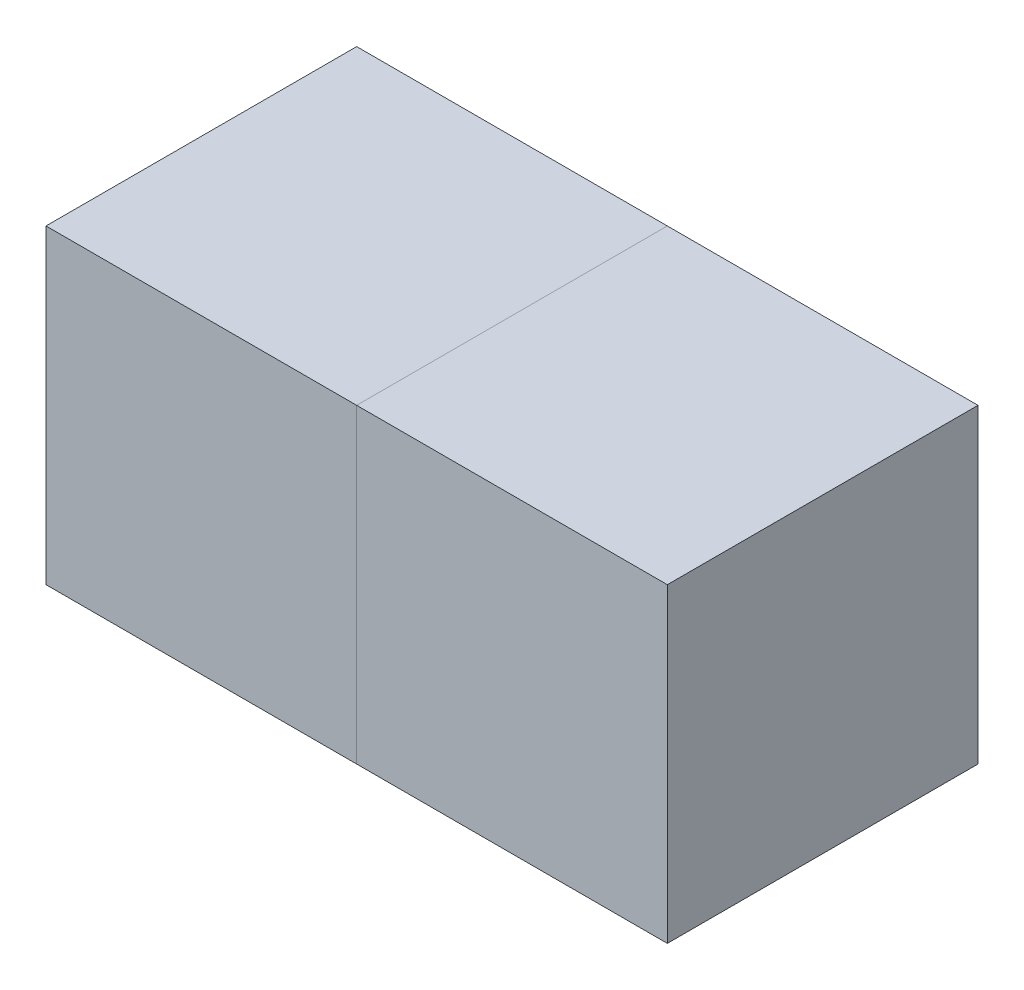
ISO-10303-21;
HEADER;
FILE_DESCRIPTION(('STEP AP214'),'2;1');
FILE_NAME('part.step','',(''),(''),'','','');
FILE_SCHEMA(('AUTOMOTIVE_DESIGN { 1 0 10303 214 1 1 1 1 }'));
ENDSEC;
DATA;
#1=APPLICATION_CONTEXT('core data for automotive mechanical design processes');
#2=APPLICATION_PROTOCOL_DEFINITION('international standard','automotive_design',2000,#1);
#3=PRODUCT_CONTEXT('',#1,'mechanical');
#4=PRODUCT('Part','Part','',(#3));
#5=PRODUCT_RELATED_PRODUCT_CATEGORY('part','',(#4));
#6=PRODUCT_DEFINITION_FORMATION('','',#4);
#7=PRODUCT_DEFINITION_CONTEXT('part definition',#1,'design');
#8=PRODUCT_DEFINITION('design','',#6,#7);
#9=PRODUCT_DEFINITION_SHAPE('','',#8);
#10=(LENGTH_UNIT() NAMED_UNIT(*) SI_UNIT(.MILLI.,.METRE.));
#11=(NAMED_UNIT(*) PLANE_ANGLE_UNIT() SI_UNIT($,.RADIAN.));
#12=(NAMED_UNIT(*) SI_UNIT($,.STERADIAN.) SOLID_ANGLE_UNIT());
#13=UNCERTAINTY_MEASURE_WITH_UNIT(LENGTH_MEASURE(1.E-05),#10,'distance_accuracy_value','');
#14=(GEOMETRIC_REPRESENTATION_CONTEXT(3) GLOBAL_UNCERTAINTY_ASSIGNED_CONTEXT((#13)) GLOBAL_UNIT_ASSIGNED_CONTEXT((#10,
#11,#12)) REPRESENTATION_CONTEXT('',''));
#15=CARTESIAN_POINT('',(0.,0.,0.));
#16=DIRECTION('',(0.,0.,1.));
#17=DIRECTION('',(1.,0.,0.));
#18=AXIS2_PLACEMENT_3D('',#15,#16,#17);
#19=CARTESIAN_POINT('',(50.,50.,50.));
#20=DIRECTION('',(1.,0.,0.));
#21=DIRECTION('',(0.,1.,0.));
#22=AXIS2_PLACEMENT_3D('',#19,#20,#21);
#23=PLANE('',#22);
#24=DIRECTION('',(0.,-1.,0.));
#25=VECTOR('',#24,1.);
#26=CARTESIAN_POINT('',(50.,50.,-50.));
#27=LINE('',#26,#25);
#28=CARTESIAN_POINT('',(50.,50.,-50.));
#29=VERTEX_POINT('',#28);
#30=CARTESIAN_POINT('',(50.,-50.,-50.));
#31=VERTEX_POINT('',#30);
#32=EDGE_CURVE('E86',#29,#31,#27,.T.);
#33=ORIENTED_EDGE('',*,*,#32,.T.);
#34=DIRECTION('',(0.,0.,-1.));
#35=VECTOR('',#34,1.);
#36=CARTESIAN_POINT('',(50.,-50.,50.));
#37=LINE('',#36,#35);
#38=CARTESIAN_POINT('',(50.,-50.,50.));
#39=VERTEX_POINT('',#38);
#40=EDGE_CURVE('E12',#39,#31,#37,.T.);
#41=ORIENTED_EDGE('',*,*,#40,.F.);
#42=DIRECTION('',(0.,-1.,0.));
#43=VECTOR('',#42,1.);
#44=CARTESIAN_POINT('',(50.,50.,50.));
#45=LINE('',#44,#43);
#46=CARTESIAN_POINT('',(50.,50.,50.));
#47=VERTEX_POINT('',#46);
#48=EDGE_CURVE('E104',#47,#39,#45,.T.);
#49=ORIENTED_EDGE('',*,*,#48,.F.);
#50=DIRECTION('',(0.,0.,-1.));
#51=VECTOR('',#50,1.);
#52=CARTESIAN_POINT('',(50.,50.,50.));
#53=LINE('',#52,#51);
#54=EDGE_CURVE('E98',#47,#29,#53,.T.);
#55=ORIENTED_EDGE('',*,*,#54,.T.);
#56=EDGE_LOOP('',(#33,#41,#49,#55));
#57=FACE_BOUND('',#56,.T.);
#58=ADVANCED_FACE('F42',(#57),#23,.F.);
#59=CARTESIAN_POINT('',(50.,-50.,50.));
#60=DIRECTION('',(0.,1.,0.));
#61=DIRECTION('',(0.,0.,1.));
#62=AXIS2_PLACEMENT_3D('',#59,#60,#61);
#63=PLANE('',#62);
#64=DIRECTION('',(1.,0.,0.));
#65=VECTOR('',#64,1.);
#66=CARTESIAN_POINT('',(50.,-50.,-50.));
#67=LINE('',#66,#65);
#68=CARTESIAN_POINT('',(150.,-50.,-50.));
#69=VERTEX_POINT('',#68);
#70=EDGE_CURVE('E82',#31,#69,#67,.T.);
#71=ORIENTED_EDGE('',*,*,#70,.T.);
#72=DIRECTION('',(0.,0.,-1.));
#73=VECTOR('',#72,1.);
#74=CARTESIAN_POINT('',(150.,-50.,50.));
#75=LINE('',#74,#73);
#76=CARTESIAN_POINT('',(150.,-50.,50.));
#77=VERTEX_POINT('',#76);
#78=EDGE_CURVE('E49',#77,#69,#75,.T.);
#79=ORIENTED_EDGE('',*,*,#78,.F.);
#80=DIRECTION('',(1.,0.,0.));
#81=VECTOR('',#80,1.);
#82=CARTESIAN_POINT('',(50.,-50.,50.));
#83=LINE('',#82,#81);
#84=EDGE_CURVE('E94',#39,#77,#83,.T.);
#85=ORIENTED_EDGE('',*,*,#84,.F.);
#86=ORIENTED_EDGE('',*,*,#40,.T.);
#87=EDGE_LOOP('',(#71,#79,#85,#86));
#88=FACE_BOUND('',#87,.T.);
#89=ADVANCED_FACE('F93',(#88),#63,.F.);
#90=CARTESIAN_POINT('',(150.,50.,50.));
#91=DIRECTION('',(-1.,0.,0.));
#92=DIRECTION('',(0.,-1.,0.));
#93=AXIS2_PLACEMENT_3D('',#90,#91,#92);
#94=PLANE('',#93);
#95=DIRECTION('',(0.,1.,0.));
#96=VECTOR('',#95,1.);
#97=CARTESIAN_POINT('',(150.,50.,-50.));
#98=LINE('',#97,#96);
#99=CARTESIAN_POINT('',(150.,50.,-50.));
#100=VERTEX_POINT('',#99);
#101=EDGE_CURVE('E87',#69,#100,#98,.T.);
#102=ORIENTED_EDGE('',*,*,#101,.T.);
#103=DIRECTION('',(0.,0.,-1.));
#104=VECTOR('',#103,1.);
#105=CARTESIAN_POINT('',(150.,50.,50.));
#106=LINE('',#105,#104);
#107=CARTESIAN_POINT('',(150.,50.,50.));
#108=VERTEX_POINT('',#107);
#109=EDGE_CURVE('E110',#108,#100,#106,.T.);
#110=ORIENTED_EDGE('',*,*,#109,.F.);
#111=DIRECTION('',(0.,1.,0.));
#112=VECTOR('',#111,1.);
#113=CARTESIAN_POINT('',(150.,50.,50.));
#114=LINE('',#113,#112);
#115=EDGE_CURVE('E61',#77,#108,#114,.T.);
#116=ORIENTED_EDGE('',*,*,#115,.F.);
#117=ORIENTED_EDGE('',*,*,#78,.T.);
#118=EDGE_LOOP('',(#102,#110,#116,#117));
#119=FACE_BOUND('',#118,.T.);
#120=ADVANCED_FACE('F113',(#119),#94,.F.);
#121=CARTESIAN_POINT('',(50.,50.,50.));
#122=DIRECTION('',(0.,-1.,0.));
#123=DIRECTION('',(0.,0.,-1.));
#124=AXIS2_PLACEMENT_3D('',#121,#122,#123);
#125=PLANE('',#124);
#126=DIRECTION('',(-1.,0.,0.));
#127=VECTOR('',#126,1.);
#128=CARTESIAN_POINT('',(50.,50.,-50.));
#129=LINE('',#128,#127);
#130=EDGE_CURVE('E102',#100,#29,#129,.T.);
#131=ORIENTED_EDGE('',*,*,#130,.T.);
#132=ORIENTED_EDGE('',*,*,#54,.F.);
#133=DIRECTION('',(-1.,0.,0.));
#134=VECTOR('',#133,1.);
#135=CARTESIAN_POINT('',(50.,50.,50.));
#136=LINE('',#135,#134);
#137=EDGE_CURVE('E56',#108,#47,#136,.T.);
#138=ORIENTED_EDGE('',*,*,#137,.F.);
#139=ORIENTED_EDGE('',*,*,#109,.T.);
#140=EDGE_LOOP('',(#131,#132,#138,#139));
#141=FACE_BOUND('',#140,.T.);
#142=ADVANCED_FACE('F115',(#141),#125,.F.);
#143=CARTESIAN_POINT('',(50.,-50.,50.));
#144=DIRECTION('',(0.,0.,1.));
#145=DIRECTION('',(1.,0.,0.));
#146=AXIS2_PLACEMENT_3D('',#143,#144,#145);
#147=PLANE('',#146);
#148=ORIENTED_EDGE('',*,*,#48,.T.);
#149=ORIENTED_EDGE('',*,*,#84,.T.);
#150=ORIENTED_EDGE('',*,*,#115,.T.);
#151=ORIENTED_EDGE('',*,*,#137,.T.);
#152=EDGE_LOOP('',(#148,#149,#150,#151));
#153=FACE_BOUND('',#152,.T.);
#154=ADVANCED_FACE('F116',(#153),#147,.T.);
#155=CARTESIAN_POINT('',(50.,-50.,-50.));
#156=DIRECTION('',(0.,0.,1.));
#157=DIRECTION('',(1.,0.,0.));
#158=AXIS2_PLACEMENT_3D('',#155,#156,#157);
#159=PLANE('',#158);
#160=ORIENTED_EDGE('',*,*,#32,.F.);
#161=ORIENTED_EDGE('',*,*,#130,.F.);
#162=ORIENTED_EDGE('',*,*,#101,.F.);
#163=ORIENTED_EDGE('',*,*,#70,.F.);
#164=EDGE_LOOP('',(#160,#161,#162,#163));
#165=FACE_BOUND('',#164,.T.);
#166=ADVANCED_FACE('F83',(#165),#159,.F.);
#167=CLOSED_SHELL('',(#58,#89,#120,#142,#154,#166));
#168=MANIFOLD_SOLID_BREP('B2',#167);
#169=CARTESIAN_POINT('',(-50.,50.,50.));
#170=DIRECTION('',(1.,0.,0.));
#171=DIRECTION('',(0.,1.,0.));
#172=AXIS2_PLACEMENT_3D('',#169,#170,#171);
#173=PLANE('',#172);
#174=DIRECTION('',(0.,-1.,0.));
#175=VECTOR('',#174,1.);
#176=CARTESIAN_POINT('',(-50.,50.,-50.));
#177=LINE('',#176,#175);
#178=CARTESIAN_POINT('',(-50.,50.,-50.));
#179=VERTEX_POINT('',#178);
#180=CARTESIAN_POINT('',(-50.,-50.,-50.));
#181=VERTEX_POINT('',#180);
#182=EDGE_CURVE('E209',#179,#181,#177,.T.);
#183=ORIENTED_EDGE('',*,*,#182,.T.);
#184=DIRECTION('',(0.,0.,-1.));
#185=VECTOR('',#184,1.);
#186=CARTESIAN_POINT('',(-50.,-50.,50.));
#187=LINE('',#186,#185);
#188=CARTESIAN_POINT('',(-50.,-50.,50.));
#189=VERTEX_POINT('',#188);
#190=EDGE_CURVE('E40',#189,#181,#187,.T.);
#191=ORIENTED_EDGE('',*,*,#190,.F.);
#192=DIRECTION('',(0.,-1.,0.));
#193=VECTOR('',#192,1.);
#194=CARTESIAN_POINT('',(-50.,50.,50.));
#195=LINE('',#194,#193);
#196=CARTESIAN_POINT('',(-50.,50.,50.));
#197=VERTEX_POINT('',#196);
#198=EDGE_CURVE('E227',#197,#189,#195,.T.);
#199=ORIENTED_EDGE('',*,*,#198,.F.);
#200=DIRECTION('',(0.,0.,-1.));
#201=VECTOR('',#200,1.);
#202=CARTESIAN_POINT('',(-50.,50.,50.));
#203=LINE('',#202,#201);
#204=EDGE_CURVE('E221',#197,#179,#203,.T.);
#205=ORIENTED_EDGE('',*,*,#204,.T.);
#206=EDGE_LOOP('',(#183,#191,#199,#205));
#207=FACE_BOUND('',#206,.T.);
#208=ADVANCED_FACE('F165',(#207),#173,.F.);
#209=CARTESIAN_POINT('',(-50.,-50.,50.));
#210=DIRECTION('',(0.,1.,0.));
#211=DIRECTION('',(0.,0.,1.));
#212=AXIS2_PLACEMENT_3D('',#209,#210,#211);
#213=PLANE('',#212);
#214=DIRECTION('',(1.,0.,0.));
#215=VECTOR('',#214,1.);
#216=CARTESIAN_POINT('',(-50.,-50.,-50.));
#217=LINE('',#216,#215);
#218=CARTESIAN_POINT('',(50.,-50.,-50.));
#219=VERTEX_POINT('',#218);
#220=EDGE_CURVE('E205',#181,#219,#217,.T.);
#221=ORIENTED_EDGE('',*,*,#220,.T.);
#222=DIRECTION('',(0.,0.,-1.));
#223=VECTOR('',#222,1.);
#224=CARTESIAN_POINT('',(50.,-50.,50.));
#225=LINE('',#224,#223);
#226=CARTESIAN_POINT('',(50.,-50.,50.));
#227=VERTEX_POINT('',#226);
#228=EDGE_CURVE('E172',#227,#219,#225,.T.);
#229=ORIENTED_EDGE('',*,*,#228,.F.);
#230=DIRECTION('',(1.,0.,0.));
#231=VECTOR('',#230,1.);
#232=CARTESIAN_POINT('',(-50.,-50.,50.));
#233=LINE('',#232,#231);
#234=EDGE_CURVE('E217',#189,#227,#233,.T.);
#235=ORIENTED_EDGE('',*,*,#234,.F.);
#236=ORIENTED_EDGE('',*,*,#190,.T.);
#237=EDGE_LOOP('',(#221,#229,#235,#236));
#238=FACE_BOUND('',#237,.T.);
#239=ADVANCED_FACE('F216',(#238),#213,.F.);
#240=CARTESIAN_POINT('',(50.,50.,50.));
#241=DIRECTION('',(-1.,0.,0.));
#242=DIRECTION('',(0.,-1.,0.));
#243=AXIS2_PLACEMENT_3D('',#240,#241,#242);
#244=PLANE('',#243);
#245=DIRECTION('',(0.,1.,0.));
#246=VECTOR('',#245,1.);
#247=CARTESIAN_POINT('',(50.,50.,-50.));
#248=LINE('',#247,#246);
#249=CARTESIAN_POINT('',(50.,50.,-50.));
#250=VERTEX_POINT('',#249);
#251=EDGE_CURVE('E210',#219,#250,#248,.T.);
#252=ORIENTED_EDGE('',*,*,#251,.T.);
#253=DIRECTION('',(0.,0.,-1.));
#254=VECTOR('',#253,1.);
#255=CARTESIAN_POINT('',(50.,50.,50.));
#256=LINE('',#255,#254);
#257=CARTESIAN_POINT('',(50.,50.,50.));
#258=VERTEX_POINT('',#257);
#259=EDGE_CURVE('E233',#258,#250,#256,.T.);
#260=ORIENTED_EDGE('',*,*,#259,.F.);
#261=DIRECTION('',(0.,1.,0.));
#262=VECTOR('',#261,1.);
#263=CARTESIAN_POINT('',(50.,50.,50.));
#264=LINE('',#263,#262);
#265=EDGE_CURVE('E184',#227,#258,#264,.T.);
#266=ORIENTED_EDGE('',*,*,#265,.F.);
#267=ORIENTED_EDGE('',*,*,#228,.T.);
#268=EDGE_LOOP('',(#252,#260,#266,#267));
#269=FACE_BOUND('',#268,.T.);
#270=ADVANCED_FACE('F236',(#269),#244,.F.);
#271=CARTESIAN_POINT('',(-50.,50.,50.));
#272=DIRECTION('',(0.,-1.,0.));
#273=DIRECTION('',(0.,0.,-1.));
#274=AXIS2_PLACEMENT_3D('',#271,#272,#273);
#275=PLANE('',#274);
#276=DIRECTION('',(-1.,0.,0.));
#277=VECTOR('',#276,1.);
#278=CARTESIAN_POINT('',(-50.,50.,-50.));
#279=LINE('',#278,#277);
#280=EDGE_CURVE('E225',#250,#179,#279,.T.);
#281=ORIENTED_EDGE('',*,*,#280,.T.);
#282=ORIENTED_EDGE('',*,*,#204,.F.);
#283=DIRECTION('',(-1.,0.,0.));
#284=VECTOR('',#283,1.);
#285=CARTESIAN_POINT('',(-50.,50.,50.));
#286=LINE('',#285,#284);
#287=EDGE_CURVE('E179',#258,#197,#286,.T.);
#288=ORIENTED_EDGE('',*,*,#287,.F.);
#289=ORIENTED_EDGE('',*,*,#259,.T.);
#290=EDGE_LOOP('',(#281,#282,#288,#289));
#291=FACE_BOUND('',#290,.T.);
#292=ADVANCED_FACE('F238',(#291),#275,.F.);
#293=CARTESIAN_POINT('',(-50.,-50.,50.));
#294=DIRECTION('',(0.,0.,1.));
#295=DIRECTION('',(1.,0.,0.));
#296=AXIS2_PLACEMENT_3D('',#293,#294,#295);
#297=PLANE('',#296);
#298=ORIENTED_EDGE('',*,*,#198,.T.);
#299=ORIENTED_EDGE('',*,*,#234,.T.);
#300=ORIENTED_EDGE('',*,*,#265,.T.);
#301=ORIENTED_EDGE('',*,*,#287,.T.);
#302=EDGE_LOOP('',(#298,#299,#300,#301));
#303=FACE_BOUND('',#302,.T.);
#304=ADVANCED_FACE('F239',(#303),#297,.T.);
#305=CARTESIAN_POINT('',(-50.,-50.,-50.));
#306=DIRECTION('',(0.,0.,1.));
#307=DIRECTION('',(1.,0.,0.));
#308=AXIS2_PLACEMENT_3D('',#305,#306,#307);
#309=PLANE('',#308);
#310=ORIENTED_EDGE('',*,*,#182,.F.);
#311=ORIENTED_EDGE('',*,*,#280,.F.);
#312=ORIENTED_EDGE('',*,*,#251,.F.);
#313=ORIENTED_EDGE('',*,*,#220,.F.);
#314=EDGE_LOOP('',(#310,#311,#312,#313));
#315=FACE_BOUND('',#314,.T.);
#316=ADVANCED_FACE('F206',(#315),#309,.F.);
#317=CLOSED_SHELL('',(#208,#239,#270,#292,#304,#316));
#318=MANIFOLD_SOLID_BREP('B6',#317);
#319=ADVANCED_BREP_SHAPE_REPRESENTATION('',(#18,#168,#318),#14);
#320=SHAPE_DEFINITION_REPRESENTATION(#9,#319);
ENDSEC;
END-ISO-10303-21;
